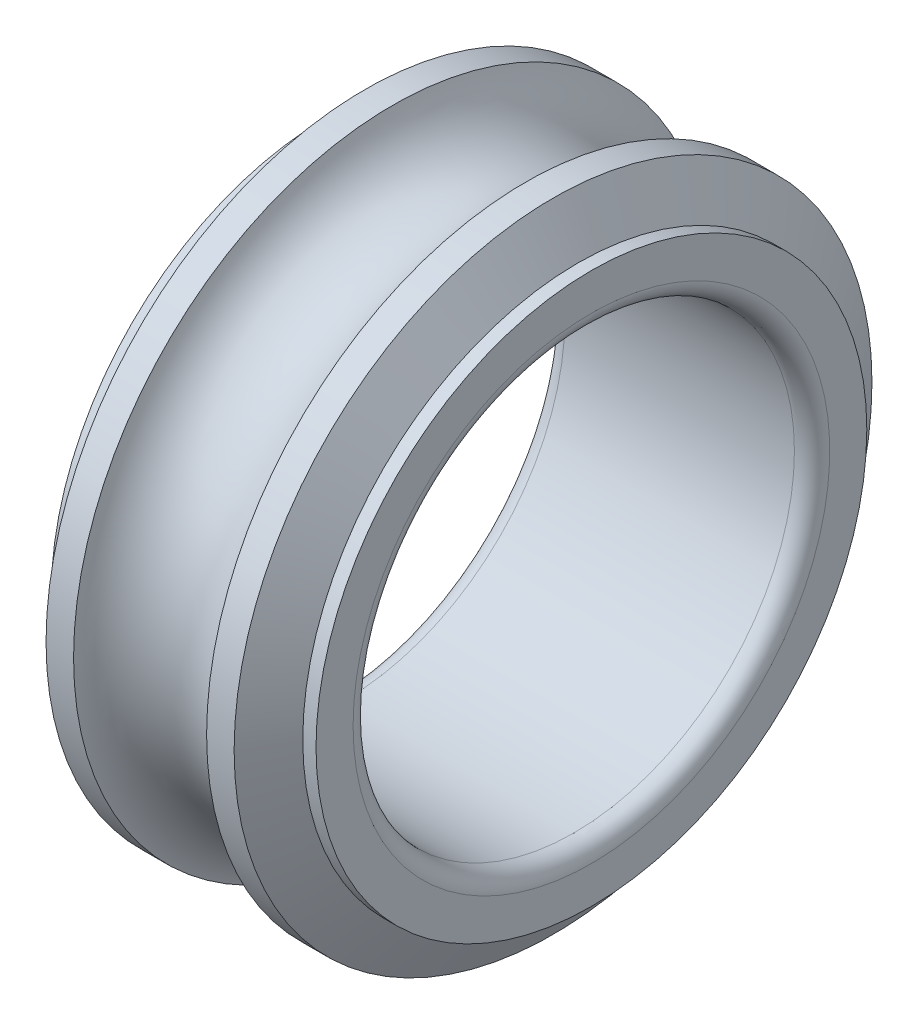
ISO-10303-21;
HEADER;
FILE_DESCRIPTION(('STEP AP214'),'2;1');
FILE_NAME('part.step','',(''),(''),'','','');
FILE_SCHEMA(('AUTOMOTIVE_DESIGN { 1 0 10303 214 1 1 1 1 }'));
ENDSEC;
DATA;
#1=APPLICATION_CONTEXT('core data for automotive mechanical design processes');
#2=APPLICATION_PROTOCOL_DEFINITION('international standard','automotive_design',2000,#1);
#3=PRODUCT_CONTEXT('',#1,'mechanical');
#4=PRODUCT('Part','Part','',(#3));
#5=PRODUCT_RELATED_PRODUCT_CATEGORY('part','',(#4));
#6=PRODUCT_DEFINITION_FORMATION('','',#4);
#7=PRODUCT_DEFINITION_CONTEXT('part definition',#1,'design');
#8=PRODUCT_DEFINITION('design','',#6,#7);
#9=PRODUCT_DEFINITION_SHAPE('','',#8);
#10=(LENGTH_UNIT() NAMED_UNIT(*) SI_UNIT(.MILLI.,.METRE.));
#11=(NAMED_UNIT(*) PLANE_ANGLE_UNIT() SI_UNIT($,.RADIAN.));
#12=(NAMED_UNIT(*) SI_UNIT($,.STERADIAN.) SOLID_ANGLE_UNIT());
#13=UNCERTAINTY_MEASURE_WITH_UNIT(LENGTH_MEASURE(1.E-05),#10,'distance_accuracy_value','');
#14=(GEOMETRIC_REPRESENTATION_CONTEXT(3) GLOBAL_UNCERTAINTY_ASSIGNED_CONTEXT((#13)) GLOBAL_UNIT_ASSIGNED_CONTEXT((#10,
#11,#12)) REPRESENTATION_CONTEXT('',''));
#15=CARTESIAN_POINT('',(0.,0.,0.));
#16=DIRECTION('',(0.,0.,1.));
#17=DIRECTION('',(1.,0.,0.));
#18=AXIS2_PLACEMENT_3D('',#15,#16,#17);
#19=CARTESIAN_POINT('',(14.,0.,0.));
#20=DIRECTION('',(-1.,0.,0.));
#21=DIRECTION('',(0.,0.,1.));
#22=AXIS2_PLACEMENT_3D('',#19,#20,#21);
#23=TOROIDAL_SURFACE('',#22,13.5,1.);
#24=CARTESIAN_POINT('',(15.,0.,0.));
#25=DIRECTION('',(-1.,0.,0.));
#26=DIRECTION('',(0.,0.,1.));
#27=AXIS2_PLACEMENT_3D('',#24,#25,#26);
#28=CIRCLE('',#27,13.5);
#29=CARTESIAN_POINT('',(15.,0.,13.5));
#30=VERTEX_POINT('',#29);
#31=EDGE_CURVE('E10',#30,#30,#28,.T.);
#32=ORIENTED_EDGE('',*,*,#31,.F.);
#33=EDGE_LOOP('',(#32));
#34=FACE_BOUND('',#33,.T.);
#35=CARTESIAN_POINT('',(14.,0.,0.));
#36=DIRECTION('',(-1.,0.,0.));
#37=DIRECTION('',(0.,0.,1.));
#38=AXIS2_PLACEMENT_3D('',#35,#36,#37);
#39=CIRCLE('',#38,12.5);
#40=CARTESIAN_POINT('',(14.,0.,12.5));
#41=VERTEX_POINT('',#40);
#42=EDGE_CURVE('E68',#41,#41,#39,.T.);
#43=ORIENTED_EDGE('',*,*,#42,.T.);
#44=EDGE_LOOP('',(#43));
#45=FACE_BOUND('',#44,.T.);
#46=ADVANCED_FACE('F28',(#34,#45),#23,.T.);
#47=CARTESIAN_POINT('',(15.,13.5,0.));
#48=DIRECTION('',(-1.,0.,0.));
#49=DIRECTION('',(0.,0.,1.));
#50=AXIS2_PLACEMENT_3D('',#47,#48,#49);
#51=PLANE('',#50);
#52=CARTESIAN_POINT('',(15.,0.,0.));
#53=DIRECTION('',(-1.,0.,0.));
#54=DIRECTION('',(0.,0.,1.));
#55=AXIS2_PLACEMENT_3D('',#52,#53,#54);
#56=CIRCLE('',#55,15.5999999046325);
#57=CARTESIAN_POINT('',(15.,0.,15.5999999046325));
#58=VERTEX_POINT('',#57);
#59=EDGE_CURVE('E34',#58,#58,#56,.T.);
#60=ORIENTED_EDGE('',*,*,#59,.F.);
#61=EDGE_LOOP('',(#60));
#62=FACE_BOUND('',#61,.T.);
#63=ORIENTED_EDGE('',*,*,#31,.T.);
#64=EDGE_LOOP('',(#63));
#65=FACE_BOUND('',#64,.T.);
#66=ADVANCED_FACE('F121',(#62,#65),#51,.F.);
#67=CARTESIAN_POINT('',(0.,0.,0.));
#68=DIRECTION('',(-1.,0.,0.));
#69=DIRECTION('',(0.,0.,1.));
#70=AXIS2_PLACEMENT_3D('',#67,#68,#69);
#71=CYLINDRICAL_SURFACE('',#70,15.5999999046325);
#72=CARTESIAN_POINT('',(14.25,0.,0.));
#73=DIRECTION('',(-1.,0.,0.));
#74=DIRECTION('',(0.,0.,1.));
#75=AXIS2_PLACEMENT_3D('',#72,#73,#74);
#76=CIRCLE('',#75,15.5999999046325);
#77=CARTESIAN_POINT('',(14.25,0.,15.5999999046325));
#78=VERTEX_POINT('',#77);
#79=EDGE_CURVE('E38',#78,#78,#76,.T.);
#80=ORIENTED_EDGE('',*,*,#79,.F.);
#81=EDGE_LOOP('',(#80));
#82=FACE_BOUND('',#81,.T.);
#83=ORIENTED_EDGE('',*,*,#59,.T.);
#84=EDGE_LOOP('',(#83));
#85=FACE_BOUND('',#84,.T.);
#86=ADVANCED_FACE('F126',(#82,#85),#71,.T.);
#87=CARTESIAN_POINT('',(14.25,0.,0.));
#88=DIRECTION('',(-1.,0.,0.));
#89=DIRECTION('',(0.,0.,1.));
#90=AXIS2_PLACEMENT_3D('',#87,#88,#89);
#91=CONICAL_SURFACE('',#90,15.5999999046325,1.0471975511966);
#92=CARTESIAN_POINT('',(12.8268315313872,0.,0.));
#93=DIRECTION('',(-1.,0.,0.));
#94=DIRECTION('',(0.,0.,1.));
#95=AXIS2_PLACEMENT_3D('',#92,#93,#94);
#96=CIRCLE('',#95,18.065);
#97=CARTESIAN_POINT('',(12.8268315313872,0.,18.065));
#98=VERTEX_POINT('',#97);
#99=EDGE_CURVE('E42',#98,#98,#96,.T.);
#100=ORIENTED_EDGE('',*,*,#99,.F.);
#101=EDGE_LOOP('',(#100));
#102=FACE_BOUND('',#101,.T.);
#103=ORIENTED_EDGE('',*,*,#79,.T.);
#104=EDGE_LOOP('',(#103));
#105=FACE_BOUND('',#104,.T.);
#106=ADVANCED_FACE('F117',(#102,#105),#91,.T.);
#107=CARTESIAN_POINT('',(0.,0.,0.));
#108=DIRECTION('',(-1.,0.,0.));
#109=DIRECTION('',(0.,0.,1.));
#110=AXIS2_PLACEMENT_3D('',#107,#108,#109);
#111=CYLINDRICAL_SURFACE('',#110,18.065);
#112=CARTESIAN_POINT('',(11.2680598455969,0.,0.));
#113=DIRECTION('',(-1.,0.,0.));
#114=DIRECTION('',(0.,0.,1.));
#115=AXIS2_PLACEMENT_3D('',#112,#113,#114);
#116=CIRCLE('',#115,18.065);
#117=CARTESIAN_POINT('',(11.2680598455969,0.,18.065));
#118=VERTEX_POINT('',#117);
#119=EDGE_CURVE('E47',#118,#118,#116,.T.);
#120=ORIENTED_EDGE('',*,*,#119,.F.);
#121=EDGE_LOOP('',(#120));
#122=FACE_BOUND('',#121,.T.);
#123=ORIENTED_EDGE('',*,*,#99,.T.);
#124=EDGE_LOOP('',(#123));
#125=FACE_BOUND('',#124,.T.);
#126=ADVANCED_FACE('F111',(#122,#125),#111,.T.);
#127=CARTESIAN_POINT('',(7.5,0.,0.));
#128=DIRECTION('',(-1.,0.,0.));
#129=DIRECTION('',(0.,0.,1.));
#130=AXIS2_PLACEMENT_3D('',#127,#128,#129);
#131=TOROIDAL_SURFACE('',#130,19.25,3.95);
#132=ORIENTED_EDGE('',*,*,#119,.T.);
#133=EDGE_LOOP('',(#132));
#134=FACE_BOUND('',#133,.T.);
#135=CARTESIAN_POINT('',(3.73194015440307,0.,0.));
#136=DIRECTION('',(-1.,0.,0.));
#137=DIRECTION('',(0.,0.,1.));
#138=AXIS2_PLACEMENT_3D('',#135,#136,#137);
#139=CIRCLE('',#138,18.065);
#140=CARTESIAN_POINT('',(3.73194015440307,0.,18.065));
#141=VERTEX_POINT('',#140);
#142=EDGE_CURVE('E50',#141,#141,#139,.T.);
#143=ORIENTED_EDGE('',*,*,#142,.F.);
#144=EDGE_LOOP('',(#143));
#145=FACE_BOUND('',#144,.T.);
#146=ADVANCED_FACE('F106',(#134,#145),#131,.F.);
#147=CARTESIAN_POINT('',(0.,0.,0.));
#148=DIRECTION('',(-1.,0.,0.));
#149=DIRECTION('',(0.,0.,1.));
#150=AXIS2_PLACEMENT_3D('',#147,#148,#149);
#151=CYLINDRICAL_SURFACE('',#150,18.065);
#152=CARTESIAN_POINT('',(2.17316846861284,0.,0.));
#153=DIRECTION('',(-1.,0.,0.));
#154=DIRECTION('',(0.,0.,1.));
#155=AXIS2_PLACEMENT_3D('',#152,#153,#154);
#156=CIRCLE('',#155,18.065);
#157=CARTESIAN_POINT('',(2.17316846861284,0.,18.065));
#158=VERTEX_POINT('',#157);
#159=EDGE_CURVE('E53',#158,#158,#156,.T.);
#160=ORIENTED_EDGE('',*,*,#159,.F.);
#161=EDGE_LOOP('',(#160));
#162=FACE_BOUND('',#161,.T.);
#163=ORIENTED_EDGE('',*,*,#142,.T.);
#164=EDGE_LOOP('',(#163));
#165=FACE_BOUND('',#164,.T.);
#166=ADVANCED_FACE('F100',(#162,#165),#151,.T.);
#167=CARTESIAN_POINT('',(2.17316846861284,0.,0.));
#168=DIRECTION('',(1.,0.,0.));
#169=DIRECTION('',(0.,0.,-1.));
#170=AXIS2_PLACEMENT_3D('',#167,#168,#169);
#171=CONICAL_SURFACE('',#170,18.065,1.0471975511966);
#172=CARTESIAN_POINT('',(0.75,0.,0.));
#173=DIRECTION('',(-1.,0.,0.));
#174=DIRECTION('',(0.,0.,1.));
#175=AXIS2_PLACEMENT_3D('',#172,#173,#174);
#176=CIRCLE('',#175,15.5999999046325);
#177=CARTESIAN_POINT('',(0.75,0.,15.5999999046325));
#178=VERTEX_POINT('',#177);
#179=EDGE_CURVE('E56',#178,#178,#176,.T.);
#180=ORIENTED_EDGE('',*,*,#179,.F.);
#181=EDGE_LOOP('',(#180));
#182=FACE_BOUND('',#181,.T.);
#183=ORIENTED_EDGE('',*,*,#159,.T.);
#184=EDGE_LOOP('',(#183));
#185=FACE_BOUND('',#184,.T.);
#186=ADVANCED_FACE('F94',(#182,#185),#171,.T.);
#187=CARTESIAN_POINT('',(0.,0.,0.));
#188=DIRECTION('',(-1.,0.,0.));
#189=DIRECTION('',(0.,0.,1.));
#190=AXIS2_PLACEMENT_3D('',#187,#188,#189);
#191=CYLINDRICAL_SURFACE('',#190,15.5999999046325);
#192=CARTESIAN_POINT('',(0.,0.,0.));
#193=DIRECTION('',(-1.,0.,0.));
#194=DIRECTION('',(0.,0.,1.));
#195=AXIS2_PLACEMENT_3D('',#192,#193,#194);
#196=CIRCLE('',#195,15.5999999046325);
#197=CARTESIAN_POINT('',(0.,0.,15.5999999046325));
#198=VERTEX_POINT('',#197);
#199=EDGE_CURVE('E59',#198,#198,#196,.T.);
#200=ORIENTED_EDGE('',*,*,#199,.F.);
#201=EDGE_LOOP('',(#200));
#202=FACE_BOUND('',#201,.T.);
#203=ORIENTED_EDGE('',*,*,#179,.T.);
#204=EDGE_LOOP('',(#203));
#205=FACE_BOUND('',#204,.T.);
#206=ADVANCED_FACE('F88',(#202,#205),#191,.T.);
#207=CARTESIAN_POINT('',(0.,15.5999999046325,0.));
#208=DIRECTION('',(1.,0.,0.));
#209=DIRECTION('',(0.,0.,-1.));
#210=AXIS2_PLACEMENT_3D('',#207,#208,#209);
#211=PLANE('',#210);
#212=CARTESIAN_POINT('',(0.,0.,0.));
#213=DIRECTION('',(-1.,0.,0.));
#214=DIRECTION('',(0.,0.,1.));
#215=AXIS2_PLACEMENT_3D('',#212,#213,#214);
#216=CIRCLE('',#215,13.5);
#217=CARTESIAN_POINT('',(0.,0.,13.5));
#218=VERTEX_POINT('',#217);
#219=EDGE_CURVE('E62',#218,#218,#216,.T.);
#220=ORIENTED_EDGE('',*,*,#219,.F.);
#221=EDGE_LOOP('',(#220));
#222=FACE_BOUND('',#221,.T.);
#223=ORIENTED_EDGE('',*,*,#199,.T.);
#224=EDGE_LOOP('',(#223));
#225=FACE_BOUND('',#224,.T.);
#226=ADVANCED_FACE('F82',(#222,#225),#211,.F.);
#227=CARTESIAN_POINT('',(1.,0.,0.));
#228=DIRECTION('',(-1.,0.,0.));
#229=DIRECTION('',(0.,0.,1.));
#230=AXIS2_PLACEMENT_3D('',#227,#228,#229);
#231=TOROIDAL_SURFACE('',#230,13.5,1.);
#232=CARTESIAN_POINT('',(1.,0.,0.));
#233=DIRECTION('',(-1.,0.,0.));
#234=DIRECTION('',(0.,0.,1.));
#235=AXIS2_PLACEMENT_3D('',#232,#233,#234);
#236=CIRCLE('',#235,12.5);
#237=CARTESIAN_POINT('',(1.,0.,12.5));
#238=VERTEX_POINT('',#237);
#239=EDGE_CURVE('E65',#238,#238,#236,.T.);
#240=ORIENTED_EDGE('',*,*,#239,.F.);
#241=EDGE_LOOP('',(#240));
#242=FACE_BOUND('',#241,.T.);
#243=ORIENTED_EDGE('',*,*,#219,.T.);
#244=EDGE_LOOP('',(#243));
#245=FACE_BOUND('',#244,.T.);
#246=ADVANCED_FACE('F76',(#242,#245),#231,.T.);
#247=CARTESIAN_POINT('',(0.,0.,0.));
#248=DIRECTION('',(-1.,0.,0.));
#249=DIRECTION('',(0.,0.,1.));
#250=AXIS2_PLACEMENT_3D('',#247,#248,#249);
#251=CYLINDRICAL_SURFACE('',#250,12.5);
#252=ORIENTED_EDGE('',*,*,#42,.F.);
#253=EDGE_LOOP('',(#252));
#254=FACE_BOUND('',#253,.T.);
#255=ORIENTED_EDGE('',*,*,#239,.T.);
#256=EDGE_LOOP('',(#255));
#257=FACE_BOUND('',#256,.T.);
#258=ADVANCED_FACE('F73',(#254,#257),#251,.F.);
#259=CLOSED_SHELL('',(#46,#66,#86,#106,#126,#146,#166,#186,#206,#226,#246,#258));
#260=MANIFOLD_SOLID_BREP('B2',#259);
#261=ADVANCED_BREP_SHAPE_REPRESENTATION('',(#18,#260),#14);
#262=SHAPE_DEFINITION_REPRESENTATION(#9,#261);
ENDSEC;
END-ISO-10303-21;
